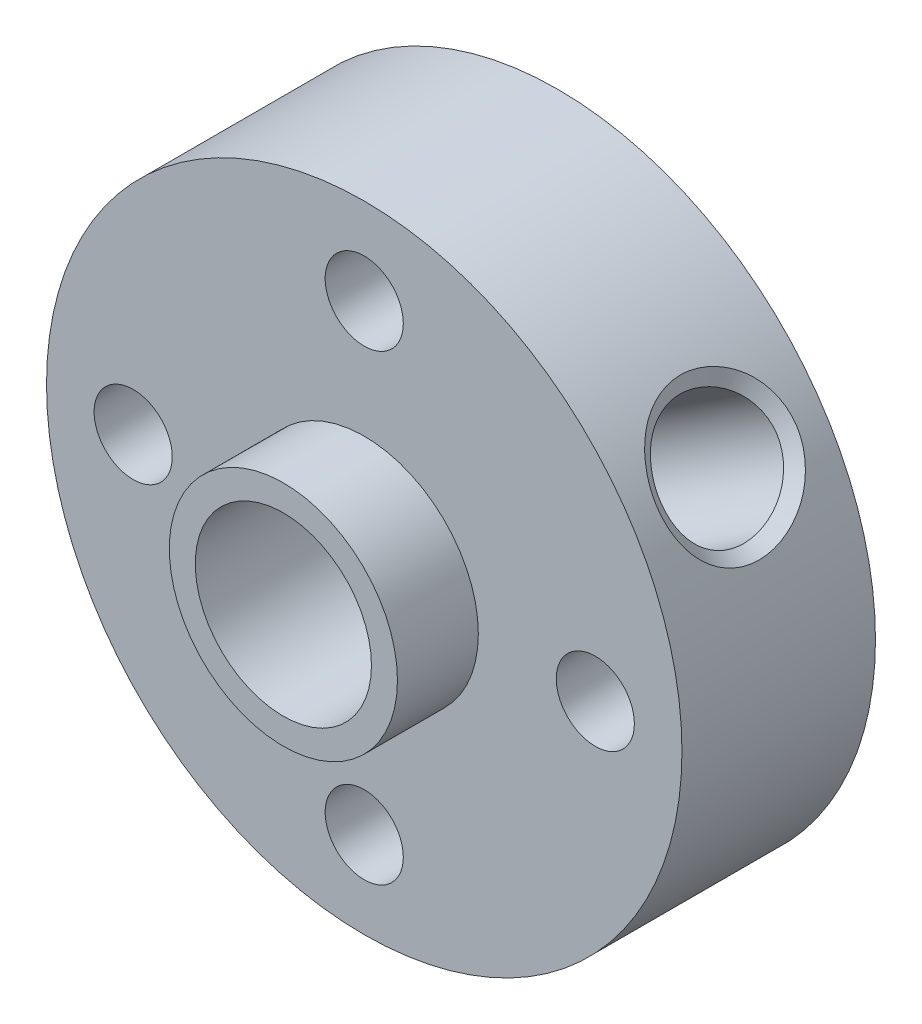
ISO-10303-21;
HEADER;
FILE_DESCRIPTION(('STEP AP214'),'2;1');
FILE_NAME('part.step','',(''),(''),'','','');
FILE_SCHEMA(('AUTOMOTIVE_DESIGN { 1 0 10303 214 1 1 1 1 }'));
ENDSEC;
DATA;
#1=APPLICATION_CONTEXT('core data for automotive mechanical design processes');
#2=APPLICATION_PROTOCOL_DEFINITION('international standard','automotive_design',2000,#1);
#3=PRODUCT_CONTEXT('',#1,'mechanical');
#4=PRODUCT('Part','Part','',(#3));
#5=PRODUCT_RELATED_PRODUCT_CATEGORY('part','',(#4));
#6=PRODUCT_DEFINITION_FORMATION('','',#4);
#7=PRODUCT_DEFINITION_CONTEXT('part definition',#1,'design');
#8=PRODUCT_DEFINITION('design','',#6,#7);
#9=PRODUCT_DEFINITION_SHAPE('','',#8);
#10=(LENGTH_UNIT() NAMED_UNIT(*) SI_UNIT(.MILLI.,.METRE.));
#11=(NAMED_UNIT(*) PLANE_ANGLE_UNIT() SI_UNIT($,.RADIAN.));
#12=(NAMED_UNIT(*) SI_UNIT($,.STERADIAN.) SOLID_ANGLE_UNIT());
#13=UNCERTAINTY_MEASURE_WITH_UNIT(LENGTH_MEASURE(1.E-05),#10,'distance_accuracy_value','');
#14=(GEOMETRIC_REPRESENTATION_CONTEXT(3) GLOBAL_UNCERTAINTY_ASSIGNED_CONTEXT((#13)) GLOBAL_UNIT_ASSIGNED_CONTEXT((#10,
#11,#12)) REPRESENTATION_CONTEXT('',''));
#15=CARTESIAN_POINT('',(0.,0.,0.));
#16=DIRECTION('',(0.,0.,1.));
#17=DIRECTION('',(1.,0.,0.));
#18=AXIS2_PLACEMENT_3D('',#15,#16,#17);
#19=CARTESIAN_POINT('',(0.,0.,0.));
#20=DIRECTION('',(0.,0.,1.));
#21=DIRECTION('',(1.,0.,0.));
#22=AXIS2_PLACEMENT_3D('',#19,#20,#21);
#23=PLANE('',#22);
#24=CARTESIAN_POINT('',(0.,8.,0.));
#25=DIRECTION('',(0.,0.,1.));
#26=DIRECTION('',(1.,0.,0.));
#27=AXIS2_PLACEMENT_3D('',#24,#25,#26);
#28=CIRCLE('',#27,1.35254999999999);
#29=CARTESIAN_POINT('',(1.35254999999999,8.,0.));
#30=VERTEX_POINT('',#29);
#31=EDGE_CURVE('E341',#30,#30,#28,.T.);
#32=ORIENTED_EDGE('',*,*,#31,.F.);
#33=EDGE_LOOP('',(#32));
#34=FACE_BOUND('',#33,.T.);
#35=CARTESIAN_POINT('',(-8.,0.,0.));
#36=DIRECTION('',(0.,0.,1.));
#37=DIRECTION('',(1.,0.,0.));
#38=AXIS2_PLACEMENT_3D('',#35,#36,#37);
#39=CIRCLE('',#38,1.35254999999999);
#40=CARTESIAN_POINT('',(-6.64745000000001,0.,0.));
#41=VERTEX_POINT('',#40);
#42=EDGE_CURVE('E343',#41,#41,#39,.T.);
#43=ORIENTED_EDGE('',*,*,#42,.F.);
#44=EDGE_LOOP('',(#43));
#45=FACE_BOUND('',#44,.T.);
#46=CARTESIAN_POINT('',(8.,0.,0.));
#47=DIRECTION('',(0.,0.,1.));
#48=DIRECTION('',(1.,0.,0.));
#49=AXIS2_PLACEMENT_3D('',#46,#47,#48);
#50=CIRCLE('',#49,1.35254999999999);
#51=CARTESIAN_POINT('',(9.35254999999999,0.,0.));
#52=VERTEX_POINT('',#51);
#53=EDGE_CURVE('E232',#52,#52,#50,.T.);
#54=ORIENTED_EDGE('',*,*,#53,.F.);
#55=EDGE_LOOP('',(#54));
#56=FACE_BOUND('',#55,.T.);
#57=CARTESIAN_POINT('',(0.,-8.,0.));
#58=DIRECTION('',(0.,0.,1.));
#59=DIRECTION('',(1.,0.,0.));
#60=AXIS2_PLACEMENT_3D('',#57,#58,#59);
#61=CIRCLE('',#60,1.35254999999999);
#62=CARTESIAN_POINT('',(1.35254999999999,-8.,0.));
#63=VERTEX_POINT('',#62);
#64=EDGE_CURVE('E231',#63,#63,#61,.T.);
#65=ORIENTED_EDGE('',*,*,#64,.F.);
#66=EDGE_LOOP('',(#65));
#67=FACE_BOUND('',#66,.T.);
#68=CARTESIAN_POINT('',(0.,0.,0.));
#69=DIRECTION('',(0.,0.,1.));
#70=DIRECTION('',(1.,0.,0.));
#71=AXIS2_PLACEMENT_3D('',#68,#69,#70);
#72=CIRCLE('',#71,11.);
#73=CARTESIAN_POINT('',(11.,0.,0.));
#74=VERTEX_POINT('',#73);
#75=EDGE_CURVE('E128',#74,#74,#72,.T.);
#76=ORIENTED_EDGE('',*,*,#75,.T.);
#77=EDGE_LOOP('',(#76));
#78=FACE_BOUND('',#77,.T.);
#79=CARTESIAN_POINT('',(0.,0.,0.));
#80=DIRECTION('',(0.,0.,1.));
#81=DIRECTION('',(1.,0.,0.));
#82=AXIS2_PLACEMENT_3D('',#79,#80,#81);
#83=CIRCLE('',#82,3.95);
#84=CARTESIAN_POINT('',(3.95,0.,0.));
#85=VERTEX_POINT('',#84);
#86=EDGE_CURVE('E135',#85,#85,#83,.T.);
#87=ORIENTED_EDGE('',*,*,#86,.F.);
#88=EDGE_LOOP('',(#87));
#89=FACE_BOUND('',#88,.T.);
#90=ADVANCED_FACE('F31',(#34,#45,#56,#67,#78,#89),#23,.T.);
#91=CARTESIAN_POINT('',(0.,0.,-6.7));
#92=DIRECTION('',(0.,0.,1.));
#93=DIRECTION('',(1.,0.,0.));
#94=AXIS2_PLACEMENT_3D('',#91,#92,#93);
#95=CYLINDRICAL_SURFACE('',#94,11.);
#96=CARTESIAN_POINT('',(7.62068264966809,7.93254032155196,-3.32685345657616));
#97=CARTESIAN_POINT('',(7.62075976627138,7.93245790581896,-2.68910121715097));
#98=CARTESIAN_POINT('',(7.82560646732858,7.74245905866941,-2.06178912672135));
#99=CARTESIAN_POINT('',(8.45565411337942,7.05350504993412,-1.16750041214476));
#100=CARTESIAN_POINT('',(8.86420959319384,6.54676611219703,-0.905037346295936));
#101=CARTESIAN_POINT('',(9.58057771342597,5.4444732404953,-0.905479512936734));
#102=CARTESIAN_POINT('',(9.87817200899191,4.86515984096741,-1.16662287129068));
#103=CARTESIAN_POINT('',(10.2532621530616,4.00757133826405,-2.06110272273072));
#104=CARTESIAN_POINT('',(10.3434017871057,3.743514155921,-2.68660918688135));
#105=CARTESIAN_POINT('',(10.343489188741,3.74331038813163,-3.96681461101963));
#106=CARTESIAN_POINT('',(10.2534497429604,4.00705371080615,-4.59170482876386));
#107=CARTESIAN_POINT('',(9.87860064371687,4.86427917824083,-5.48652188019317));
#108=CARTESIAN_POINT('',(9.58062819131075,5.4444282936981,-5.74828985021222));
#109=CARTESIAN_POINT('',(8.8641064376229,6.54689208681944,-5.74860707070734));
#110=CARTESIAN_POINT('',(8.4560806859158,7.05297750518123,-5.48645317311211));
#111=CARTESIAN_POINT('',(7.8258487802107,7.74225053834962,-4.59262259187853));
#112=CARTESIAN_POINT('',(7.6206055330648,7.93262273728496,-3.96460569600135));
#113=CARTESIAN_POINT('',(7.62068264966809,7.93254032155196,-3.32685345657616));
#114=B_SPLINE_CURVE_WITH_KNOTS('',3,(#96,#97,#98,#99,#100,#101,#102,#103,#104,#105,#106,#107,
#108,#109,#110,#111,#112,#113),.UNSPECIFIED.,.T.,.F.,(4,2,2,2,2,2,2,2,4),(-3.18999496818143E-06,
0.00189587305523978,0.00379493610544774,0.00569399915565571,0.00759306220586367,
0.00949212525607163,0.0113911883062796,0.0132902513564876,0.0151893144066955),.UNSPECIFIED.);
#115=CARTESIAN_POINT('',(7.62068264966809,7.93254032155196,-3.32685345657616));
#116=VERTEX_POINT('',#115);
#117=EDGE_CURVE('E11',#116,#116,#114,.F.);
#118=ORIENTED_EDGE('',*,*,#117,.T.);
#119=EDGE_LOOP('',(#118));
#120=FACE_BOUND('',#119,.T.);
#121=CARTESIAN_POINT('',(0.,0.,-6.7));
#122=DIRECTION('',(0.,0.,1.));
#123=DIRECTION('',(1.,0.,0.));
#124=AXIS2_PLACEMENT_3D('',#121,#122,#123);
#125=CIRCLE('',#124,11.);
#126=CARTESIAN_POINT('',(11.,0.,-6.7));
#127=VERTEX_POINT('',#126);
#128=EDGE_CURVE('E125',#127,#127,#125,.T.);
#129=ORIENTED_EDGE('',*,*,#128,.T.);
#130=EDGE_LOOP('',(#129));
#131=FACE_BOUND('',#130,.T.);
#132=ORIENTED_EDGE('',*,*,#75,.F.);
#133=EDGE_LOOP('',(#132));
#134=FACE_BOUND('',#133,.T.);
#135=ADVANCED_FACE('F84',(#120,#131,#134),#95,.T.);
#136=CARTESIAN_POINT('',(0.,0.,-6.7));
#137=DIRECTION('',(0.,0.,1.));
#138=DIRECTION('',(1.,0.,0.));
#139=AXIS2_PLACEMENT_3D('',#136,#137,#138);
#140=PLANE('',#139);
#141=CARTESIAN_POINT('',(0.,8.,-6.7));
#142=DIRECTION('',(0.,0.,1.));
#143=DIRECTION('',(1.,0.,0.));
#144=AXIS2_PLACEMENT_3D('',#141,#142,#143);
#145=CIRCLE('',#144,1.35255);
#146=CARTESIAN_POINT('',(1.35255,8.,-6.7));
#147=VERTEX_POINT('',#146);
#148=EDGE_CURVE('E216',#147,#147,#145,.T.);
#149=ORIENTED_EDGE('',*,*,#148,.T.);
#150=EDGE_LOOP('',(#149));
#151=FACE_BOUND('',#150,.T.);
#152=CARTESIAN_POINT('',(-8.,0.,-6.7));
#153=DIRECTION('',(0.,0.,1.));
#154=DIRECTION('',(1.,0.,0.));
#155=AXIS2_PLACEMENT_3D('',#152,#153,#154);
#156=CIRCLE('',#155,1.35255);
#157=CARTESIAN_POINT('',(-6.64745,0.,-6.7));
#158=VERTEX_POINT('',#157);
#159=EDGE_CURVE('E220',#158,#158,#156,.T.);
#160=ORIENTED_EDGE('',*,*,#159,.T.);
#161=EDGE_LOOP('',(#160));
#162=FACE_BOUND('',#161,.T.);
#163=CARTESIAN_POINT('',(8.,0.,-6.7));
#164=DIRECTION('',(0.,0.,1.));
#165=DIRECTION('',(1.,0.,0.));
#166=AXIS2_PLACEMENT_3D('',#163,#164,#165);
#167=CIRCLE('',#166,1.35255);
#168=CARTESIAN_POINT('',(9.35255,0.,-6.7));
#169=VERTEX_POINT('',#168);
#170=EDGE_CURVE('E224',#169,#169,#167,.T.);
#171=ORIENTED_EDGE('',*,*,#170,.T.);
#172=EDGE_LOOP('',(#171));
#173=FACE_BOUND('',#172,.T.);
#174=CARTESIAN_POINT('',(0.,-8.,-6.7));
#175=DIRECTION('',(0.,0.,1.));
#176=DIRECTION('',(1.,0.,0.));
#177=AXIS2_PLACEMENT_3D('',#174,#175,#176);
#178=CIRCLE('',#177,1.35255);
#179=CARTESIAN_POINT('',(1.35255,-8.,-6.7));
#180=VERTEX_POINT('',#179);
#181=EDGE_CURVE('E228',#180,#180,#178,.T.);
#182=ORIENTED_EDGE('',*,*,#181,.T.);
#183=EDGE_LOOP('',(#182));
#184=FACE_BOUND('',#183,.T.);
#185=CARTESIAN_POINT('',(0.,0.,-6.7));
#186=DIRECTION('',(0.,0.,1.));
#187=DIRECTION('',(1.,0.,0.));
#188=AXIS2_PLACEMENT_3D('',#185,#186,#187);
#189=CIRCLE('',#188,3.05);
#190=CARTESIAN_POINT('',(3.05,0.,-6.7));
#191=VERTEX_POINT('',#190);
#192=EDGE_CURVE('E190',#191,#191,#189,.T.);
#193=ORIENTED_EDGE('',*,*,#192,.T.);
#194=EDGE_LOOP('',(#193));
#195=FACE_BOUND('',#194,.T.);
#196=ORIENTED_EDGE('',*,*,#128,.F.);
#197=EDGE_LOOP('',(#196));
#198=FACE_BOUND('',#197,.T.);
#199=ADVANCED_FACE('F90',(#151,#162,#173,#184,#195,#198),#140,.F.);
#200=CARTESIAN_POINT('',(0.,0.,2.8));
#201=DIRECTION('',(0.,0.,-1.));
#202=DIRECTION('',(-1.,0.,0.));
#203=AXIS2_PLACEMENT_3D('',#200,#201,#202);
#204=CYLINDRICAL_SURFACE('',#203,3.95);
#205=CARTESIAN_POINT('',(0.,0.,2.8));
#206=DIRECTION('',(0.,0.,1.));
#207=DIRECTION('',(1.,0.,0.));
#208=AXIS2_PLACEMENT_3D('',#205,#206,#207);
#209=CIRCLE('',#208,3.95);
#210=CARTESIAN_POINT('',(3.95,0.,2.8));
#211=VERTEX_POINT('',#210);
#212=EDGE_CURVE('E130',#211,#211,#209,.T.);
#213=ORIENTED_EDGE('',*,*,#212,.F.);
#214=EDGE_LOOP('',(#213));
#215=FACE_BOUND('',#214,.T.);
#216=ORIENTED_EDGE('',*,*,#86,.T.);
#217=EDGE_LOOP('',(#216));
#218=FACE_BOUND('',#217,.T.);
#219=ADVANCED_FACE('F200',(#215,#218),#204,.T.);
#220=CARTESIAN_POINT('',(0.,0.,2.8));
#221=DIRECTION('',(0.,0.,1.));
#222=DIRECTION('',(1.,0.,0.));
#223=AXIS2_PLACEMENT_3D('',#220,#221,#222);
#224=PLANE('',#223);
#225=CARTESIAN_POINT('',(0.,0.,2.8));
#226=DIRECTION('',(0.,0.,1.));
#227=DIRECTION('',(1.,0.,0.));
#228=AXIS2_PLACEMENT_3D('',#225,#226,#227);
#229=CIRCLE('',#228,3.05);
#230=CARTESIAN_POINT('',(3.05,0.,2.8));
#231=VERTEX_POINT('',#230);
#232=EDGE_CURVE('E170',#231,#231,#229,.T.);
#233=ORIENTED_EDGE('',*,*,#232,.F.);
#234=EDGE_LOOP('',(#233));
#235=FACE_BOUND('',#234,.T.);
#236=ORIENTED_EDGE('',*,*,#212,.T.);
#237=EDGE_LOOP('',(#236));
#238=FACE_BOUND('',#237,.T.);
#239=ADVANCED_FACE('F78',(#235,#238),#224,.T.);
#240=CARTESIAN_POINT('',(0.,0.,-6.7));
#241=DIRECTION('',(0.,0.,1.));
#242=DIRECTION('',(1.,0.,0.));
#243=AXIS2_PLACEMENT_3D('',#240,#241,#242);
#244=CYLINDRICAL_SURFACE('',#243,3.05);
#245=CARTESIAN_POINT('',(3.05,0.,-4.47352631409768));
#246=CARTESIAN_POINT('',(3.04999845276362,0.0792072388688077,-4.56979697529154));
#247=CARTESIAN_POINT('',(3.04689484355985,0.165980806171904,-4.65986221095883));
#248=CARTESIAN_POINT('',(3.03113479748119,0.35127712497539,-4.82649271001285));
#249=CARTESIAN_POINT('',(3.0184552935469,0.44982776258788,-4.90302482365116));
#250=CARTESIAN_POINT('',(2.98050916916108,0.655805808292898,-5.04073084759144));
#251=CARTESIAN_POINT('',(2.9551778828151,0.763276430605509,-5.10182340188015));
#252=CARTESIAN_POINT('',(2.88965422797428,0.982557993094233,-5.20524126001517));
#253=CARTESIAN_POINT('',(2.84949150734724,1.09435987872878,-5.24760363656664));
#254=CARTESIAN_POINT('',(2.75910951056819,1.30434664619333,-5.30711696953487));
#255=CARTESIAN_POINT('',(2.71061209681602,1.40259718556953,-5.32663418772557));
#256=CARTESIAN_POINT('',(2.60225104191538,1.59464910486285,-5.34754198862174));
#257=CARTESIAN_POINT('',(2.5423958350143,1.68845372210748,-5.34894596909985));
#258=CARTESIAN_POINT('',(2.42209874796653,1.8561185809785,-5.33458313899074));
#259=CARTESIAN_POINT('',(2.362764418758,1.93098074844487,-5.32104524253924));
#260=CARTESIAN_POINT('',(2.23932539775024,2.07286356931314,-5.28099605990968));
#261=CARTESIAN_POINT('',(2.17522019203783,2.13988337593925,-5.2544833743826));
#262=CARTESIAN_POINT('',(2.04291754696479,2.26662535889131,-5.18889881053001));
#263=CARTESIAN_POINT('',(1.97465875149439,2.32613309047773,-5.14954003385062));
#264=CARTESIAN_POINT('',(1.83780246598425,2.43570893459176,-5.05990005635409));
#265=CARTESIAN_POINT('',(1.76920490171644,2.48577487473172,-5.00961634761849));
#266=CARTESIAN_POINT('',(1.62406015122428,2.58333625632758,-4.89147472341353));
#267=CARTESIAN_POINT('',(1.54778391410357,2.62943309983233,-4.82213059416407));
#268=CARTESIAN_POINT('',(1.40051133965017,2.7107499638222,-4.6721293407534));
#269=CARTESIAN_POINT('',(1.32952492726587,2.7459499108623,-4.59145173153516));
#270=CARTESIAN_POINT('',(1.1870136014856,2.8107696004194,-4.40784888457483));
#271=CARTESIAN_POINT('',(1.11678294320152,2.83893553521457,-4.30338997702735));
#272=CARTESIAN_POINT('',(0.994036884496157,2.88421390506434,-4.08241277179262));
#273=CARTESIAN_POINT('',(0.94147426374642,2.90135591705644,-3.96592772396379));
#274=CARTESIAN_POINT('',(0.87394109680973,2.92225371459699,-3.76122271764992));
#275=CARTESIAN_POINT('',(0.852367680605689,2.92851221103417,-3.67544002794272));
#276=CARTESIAN_POINT('',(0.823406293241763,2.93679098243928,-3.50136018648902));
#277=CARTESIAN_POINT('',(0.815997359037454,2.93881752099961,-3.41306694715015));
#278=CARTESIAN_POINT('',(0.816229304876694,2.93875307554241,-3.23638008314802));
#279=CARTESIAN_POINT('',(0.823891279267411,2.93665632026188,-3.14798649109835));
#280=CARTESIAN_POINT('',(0.85337210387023,2.92822113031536,-2.97375701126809));
#281=CARTESIAN_POINT('',(0.875210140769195,2.92187694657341,-2.88792475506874));
#282=CARTESIAN_POINT('',(0.937500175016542,2.90256511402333,-2.70075411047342));
#283=CARTESIAN_POINT('',(0.981155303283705,2.888376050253,-2.6006182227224));
#284=CARTESIAN_POINT('',(1.08203096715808,2.85211716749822,-2.40900904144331));
#285=CARTESIAN_POINT('',(1.1392697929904,2.83003670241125,-2.31754766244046));
#286=CARTESIAN_POINT('',(1.26426811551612,2.7764779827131,-2.14265267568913));
#287=CARTESIAN_POINT('',(1.33219299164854,2.74484324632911,-2.05938598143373));
#288=CARTESIAN_POINT('',(1.47437333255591,2.67116870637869,-1.90352244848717));
#289=CARTESIAN_POINT('',(1.54863054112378,2.62912603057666,-1.83092856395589));
#290=CARTESIAN_POINT('',(1.71233477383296,2.52609439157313,-1.68720166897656));
#291=CARTESIAN_POINT('',(1.8023450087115,2.46317348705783,-1.61806101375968));
#292=CARTESIAN_POINT('',(1.98200701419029,2.3210380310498,-1.49847534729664));
#293=CARTESIAN_POINT('',(2.07165903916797,2.2418385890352,-1.44801311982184));
#294=CARTESIAN_POINT('',(2.23567712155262,2.07754134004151,-1.37337031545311));
#295=CARTESIAN_POINT('',(2.31063207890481,1.99409036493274,-1.34688380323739));
#296=CARTESIAN_POINT('',(2.4523100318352,1.81699643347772,-1.31301269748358));
#297=CARTESIAN_POINT('',(2.51904329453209,1.7233664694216,-1.3056040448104));
#298=CARTESIAN_POINT('',(2.6320594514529,1.54411282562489,-1.3100321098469));
#299=CARTESIAN_POINT('',(2.6799083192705,1.4593911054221,-1.31915191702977));
#300=CARTESIAN_POINT('',(2.7664283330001,1.28786517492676,-1.35101378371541));
#301=CARTESIAN_POINT('',(2.80509877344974,1.20106080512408,-1.37375688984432));
#302=CARTESIAN_POINT('',(2.87294430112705,1.02825003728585,-1.43166343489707));
#303=CARTESIAN_POINT('',(2.90214467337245,0.9422421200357,-1.46679326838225));
#304=CARTESIAN_POINT('',(2.95173421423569,0.773013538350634,-1.54811665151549));
#305=CARTESIAN_POINT('',(2.97212172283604,0.68979340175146,-1.59431228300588));
#306=CARTESIAN_POINT('',(3.00725035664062,0.517362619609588,-1.70318361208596));
#307=CARTESIAN_POINT('',(3.02090228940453,0.428794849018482,-1.76722529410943));
#308=CARTESIAN_POINT('',(3.04011293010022,0.259750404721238,-1.90642473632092));
#309=CARTESIAN_POINT('',(3.04565902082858,0.179286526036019,-1.98159962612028));
#310=CARTESIAN_POINT('',(3.05118088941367,0.0173597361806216,-2.15425251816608));
#311=CARTESIAN_POINT('',(3.05017909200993,-0.062387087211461,-2.2533835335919));
#312=CARTESIAN_POINT('',(3.04402332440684,-0.203501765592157,-2.46385038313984));
#313=CARTESIAN_POINT('',(3.03887650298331,-0.264901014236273,-2.57516491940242));
#314=CARTESIAN_POINT('',(3.03010831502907,-0.34959950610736,-2.77503750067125));
#315=CARTESIAN_POINT('',(3.02646815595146,-0.37876533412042,-2.86110005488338));
#316=CARTESIAN_POINT('',(3.02068619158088,-0.422436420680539,-3.03686306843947));
#317=CARTESIAN_POINT('',(3.01854177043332,-0.436967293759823,-3.12655688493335));
#318=CARTESIAN_POINT('',(3.0166323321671,-0.449978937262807,-3.30751193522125));
#319=CARTESIAN_POINT('',(3.01687670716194,-0.448396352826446,-3.39877794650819));
#320=CARTESIAN_POINT('',(3.01966444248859,-0.429197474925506,-3.57962333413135));
#321=CARTESIAN_POINT('',(3.02221026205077,-0.41156403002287,-3.66920080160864));
#322=CARTESIAN_POINT('',(3.02840275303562,-0.363087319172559,-3.84032478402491));
#323=CARTESIAN_POINT('',(3.03199637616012,-0.332855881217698,-3.92205119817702));
#324=CARTESIAN_POINT('',(3.03898971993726,-0.261389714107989,-4.08041768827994));
#325=CARTESIAN_POINT('',(3.04238955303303,-0.220161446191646,-4.15706071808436));
#326=CARTESIAN_POINT('',(3.04801811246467,-0.121860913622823,-4.31556083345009));
#327=CARTESIAN_POINT('',(3.05000123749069,-0.063350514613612,-4.39652835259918));
#328=CARTESIAN_POINT('',(3.05,0.,-4.47352631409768));
#329=B_SPLINE_CURVE_WITH_KNOTS('',3,(#245,#246,#247,#248,#249,#250,#251,#252,#253,#254,#255,
#256,#257,#258,#259,#260,#261,#262,#263,#264,#265,#266,#267,#268,#269,#270,#271,#272,#273,#274,
#275,#276,#277,#278,#279,#280,#281,#282,#283,#284,#285,#286,#287,#288,#289,#290,#291,#292,#293,
#294,#295,#296,#297,#298,#299,#300,#301,#302,#303,#304,#305,#306,#307,#308,#309,#310,#311,#312,
#313,#314,#315,#316,#317,#318,#319,#320,#321,#322,#323,#324,#325,#326,#327,#328),.UNSPECIFIED.,
.T.,.F.,(4,2,2,2,2,2,2,2,2,2,2,2,2,2,2,2,2,2,2,2,2,2,2,2,2,2,2,2,2,2,2,2,2,2,2,2,2,2,2,2,2,4),
(0.,0.373643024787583,0.748188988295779,1.12466923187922,1.50040093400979,1.83225979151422,
2.16387316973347,2.45197347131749,2.74010485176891,3.03517051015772,3.33030397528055,
3.66776750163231,4.00584902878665,4.39088121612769,4.77487601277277,5.03978671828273,
5.30430505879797,5.56919390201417,5.83444201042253,6.16314301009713,6.49228913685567,
6.82714887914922,7.1621011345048,7.54927556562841,7.93609223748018,8.27970440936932,
8.62288303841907,8.91464938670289,9.20643815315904,9.49744130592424,9.78849924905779,
10.1176764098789,10.4473654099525,10.8272920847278,11.2065649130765,11.4783105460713,
11.7495797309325,12.0219159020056,12.2945434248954,12.55524078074,12.8157852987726,
13.1146276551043),.UNSPECIFIED.);
#330=CARTESIAN_POINT('',(3.05,0.,-4.47352631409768));
#331=VERTEX_POINT('',#330);
#332=EDGE_CURVE('E165',#331,#331,#329,.T.);
#333=ORIENTED_EDGE('',*,*,#332,.T.);
#334=EDGE_LOOP('',(#333));
#335=FACE_BOUND('',#334,.T.);
#336=CARTESIAN_POINT('',(-3.0483868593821,-0.0991844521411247,-2.06702311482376));
#337=CARTESIAN_POINT('',(-3.04962662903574,-0.0611311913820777,-2.10785039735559));
#338=CARTESIAN_POINT('',(-3.05010465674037,-0.0244454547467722,-2.14994255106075));
#339=CARTESIAN_POINT('',(-3.04985766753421,0.0458847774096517,-2.23666619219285));
#340=CARTESIAN_POINT('',(-3.04913133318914,0.0795259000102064,-2.28130040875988));
#341=CARTESIAN_POINT('',(-3.04560787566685,0.175808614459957,-2.41962154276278));
#342=CARTESIAN_POINT('',(-3.041456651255,0.233192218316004,-2.51707607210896));
#343=CARTESIAN_POINT('',(-3.03326755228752,0.32159443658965,-2.70313131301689));
#344=CARTESIAN_POINT('',(-3.02933210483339,0.355445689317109,-2.79038841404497));
#345=CARTESIAN_POINT('',(-3.02268886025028,0.408126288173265,-2.969107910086));
#346=CARTESIAN_POINT('',(-3.01997612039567,0.427016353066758,-3.06055169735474));
#347=CARTESIAN_POINT('',(-3.01692267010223,0.448114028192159,-3.24604798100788));
#348=CARTESIAN_POINT('',(-3.01659769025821,0.450211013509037,-3.3401136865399));
#349=CARTESIAN_POINT('',(-3.01851234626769,0.437170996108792,-3.52707719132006));
#350=CARTESIAN_POINT('',(-3.02075449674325,0.42201709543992,-3.61997375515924));
#351=CARTESIAN_POINT('',(-3.026565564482,0.377937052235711,-3.79450936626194));
#352=CARTESIAN_POINT('',(-3.03001633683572,0.350187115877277,-3.87645932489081));
#353=CARTESIAN_POINT('',(-3.03699096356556,0.283391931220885,-4.03567131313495));
#354=CARTESIAN_POINT('',(-3.04051490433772,0.244332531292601,-4.11292732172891));
#355=CARTESIAN_POINT('',(-3.04618235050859,0.158307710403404,-4.25949182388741));
#356=CARTESIAN_POINT('',(-3.04836733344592,0.111643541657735,-4.32897785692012));
#357=CARTESIAN_POINT('',(-3.05039526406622,0.0112164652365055,-4.4621470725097));
#358=CARTESIAN_POINT('',(-3.05024931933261,-0.0425115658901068,-4.52585632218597));
#359=CARTESIAN_POINT('',(-3.0483868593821,-0.0991844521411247,-4.58668379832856));
#360=B_SPLINE_CURVE_WITH_KNOTS('',3,(#336,#337,#338,#339,#340,#341,#342,#343,#344,#345,#346,
#347,#348,#349,#350,#351,#352,#353,#354,#355,#356,#357,#358,#359),.UNSPECIFIED.,.F.,.F.,(4,2,2,
2,2,2,2,2,2,2,2,4),(0.,0.167386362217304,0.334955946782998,0.672760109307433,0.952690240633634,
1.23147839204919,1.51210157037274,1.79299986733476,2.0518180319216,2.31096146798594,
2.56160715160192,2.81105878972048),.UNSPECIFIED.);
#361=CARTESIAN_POINT('',(-3.0483868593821,-0.0991844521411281,-2.06702311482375));
#362=VERTEX_POINT('',#361);
#363=CARTESIAN_POINT('',(-3.0483868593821,-0.0991844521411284,-4.58668379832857));
#364=VERTEX_POINT('',#363);
#365=EDGE_CURVE('E144',#362,#364,#360,.T.);
#366=ORIENTED_EDGE('',*,*,#365,.T.);
#367=CARTESIAN_POINT('',(-2.98979418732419,0.603018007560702,-5.04101852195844));
#368=CARTESIAN_POINT('',(-2.99665081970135,0.568983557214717,-5.00732181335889));
#369=CARTESIAN_POINT('',(-3.00309339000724,0.534078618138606,-4.97437045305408));
#370=CARTESIAN_POINT('',(-3.01500152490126,0.462181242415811,-4.91038231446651));
#371=CARTESIAN_POINT('',(-3.0204635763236,0.425181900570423,-4.8793526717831));
#372=CARTESIAN_POINT('',(-3.0302836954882,0.348418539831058,-4.81943389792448));
#373=CARTESIAN_POINT('',(-3.03462413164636,0.308621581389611,-4.79058347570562));
#374=CARTESIAN_POINT('',(-3.04184330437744,0.226675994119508,-4.73634829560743));
#375=CARTESIAN_POINT('',(-3.044724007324,0.184530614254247,-4.71095890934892));
#376=CARTESIAN_POINT('',(-3.04966468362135,0.0777993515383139,-4.65376663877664));
#377=CARTESIAN_POINT('',(-3.05073671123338,0.0118128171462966,-4.62439010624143));
#378=CARTESIAN_POINT('',(-3.04824092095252,-0.123493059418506,-4.57740707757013));
#379=CARTESIAN_POINT('',(-3.04471599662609,-0.192775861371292,-4.55969406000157));
#380=CARTESIAN_POINT('',(-3.03112308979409,-0.349868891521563,-4.53262484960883));
#381=CARTESIAN_POINT('',(-3.01966730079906,-0.438071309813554,-4.52636637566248));
#382=CARTESIAN_POINT('',(-2.98895238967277,-0.613827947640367,-4.52545362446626));
#383=CARTESIAN_POINT('',(-2.96960675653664,-0.701363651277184,-4.53093095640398));
#384=CARTESIAN_POINT('',(-2.92457316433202,-0.869833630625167,-4.54618757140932));
#385=CARTESIAN_POINT('',(-2.89922815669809,-0.950884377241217,-4.55575130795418));
#386=CARTESIAN_POINT('',(-2.84185334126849,-1.11066436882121,-4.57466458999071));
#387=CARTESIAN_POINT('',(-2.80982031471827,-1.1893924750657,-4.58401402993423));
#388=CARTESIAN_POINT('',(-2.73940940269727,-1.34359983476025,-4.59947997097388));
#389=CARTESIAN_POINT('',(-2.70108092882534,-1.41909903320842,-4.60562020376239));
#390=CARTESIAN_POINT('',(-2.61816787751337,-1.56679985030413,-4.61318166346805));
#391=CARTESIAN_POINT('',(-2.57358659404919,-1.63900317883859,-4.61460536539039));
#392=CARTESIAN_POINT('',(-2.48078540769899,-1.776159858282,-4.6124495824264));
#393=CARTESIAN_POINT('',(-2.43282635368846,-1.84129385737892,-4.60909668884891));
#394=CARTESIAN_POINT('',(-2.33204242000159,-1.96738381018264,-4.59854976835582));
#395=CARTESIAN_POINT('',(-2.27921479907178,-2.02833737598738,-4.59135356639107));
#396=CARTESIAN_POINT('',(-2.16874063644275,-2.14607189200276,-4.57485716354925));
#397=CARTESIAN_POINT('',(-2.11106692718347,-2.20282542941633,-4.56554452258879));
#398=CARTESIAN_POINT('',(-1.9913606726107,-2.31160562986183,-4.54780547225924));
#399=CARTESIAN_POINT('',(-1.92933136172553,-2.36363573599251,-4.53937841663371));
#400=CARTESIAN_POINT('',(-1.79989130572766,-2.46367197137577,-4.52759746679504));
#401=CARTESIAN_POINT('',(-1.73240980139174,-2.51159949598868,-4.5243277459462));
#402=CARTESIAN_POINT('',(-1.59434797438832,-2.60139217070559,-4.52887366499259));
#403=CARTESIAN_POINT('',(-1.52379682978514,-2.64330283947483,-4.53660064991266));
#404=CARTESIAN_POINT('',(-1.38096498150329,-2.72068448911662,-4.56756006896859));
#405=CARTESIAN_POINT('',(-1.30867423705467,-2.75604888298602,-4.59102446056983));
#406=CARTESIAN_POINT('',(-1.16688227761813,-2.81904041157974,-4.65301024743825));
#407=CARTESIAN_POINT('',(-1.09739696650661,-2.84662763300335,-4.69160696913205));
#408=CARTESIAN_POINT('',(-1.00655500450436,-2.87923394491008,-4.75110320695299));
#409=CARTESIAN_POINT('',(-0.983055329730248,-2.88733490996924,-4.76736614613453));
#410=CARTESIAN_POINT('',(-0.936791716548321,-2.90267263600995,-4.80095580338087));
#411=CARTESIAN_POINT('',(-0.914023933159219,-2.90991477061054,-4.81827475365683));
#412=CARTESIAN_POINT('',(-0.89152514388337,-2.91679325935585,-4.83609366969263));
#413=B_SPLINE_CURVE_WITH_KNOTS('',3,(#367,#368,#369,#370,#371,#372,#373,#374,#375,#376,#377,
#378,#379,#380,#381,#382,#383,#384,#385,#386,#387,#388,#389,#390,#391,#392,#393,#394,#395,#396,
#397,#398,#399,#400,#401,#402,#403,#404,#405,#406,#407,#408,#409,#410,#411,#412),.UNSPECIFIED.,
.F.,.F.,(4,2,2,2,2,2,2,2,2,2,2,2,2,2,2,2,2,2,2,2,2,2,4),(0.,0.145181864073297,0.290873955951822,
0.438733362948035,0.586393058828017,0.80201251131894,1.01563436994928,1.28143135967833,
1.55022467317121,1.8063146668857,2.06252819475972,2.31681924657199,2.57097683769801,
2.81347149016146,3.05610352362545,3.30020038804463,3.54411786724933,3.79197661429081,
4.03784841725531,4.28742623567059,4.53826251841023,4.62735573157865,4.71585825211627),.UNSPECIFIED.);
#414=CARTESIAN_POINT('',(-1.32837016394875,-2.74552958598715,-4.58668379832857));
#415=VERTEX_POINT('',#414);
#416=EDGE_CURVE('E56',#364,#415,#413,.T.);
#417=ORIENTED_EDGE('',*,*,#416,.T.);
#418=CARTESIAN_POINT('',(-1.32837016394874,-2.74552958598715,-4.58668379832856));
#419=CARTESIAN_POINT('',(-1.29409816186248,-2.7621132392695,-4.54585651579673));
#420=CARTESIAN_POINT('',(-1.26076659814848,-2.77744551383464,-4.50376436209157));
#421=CARTESIAN_POINT('',(-1.1963942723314,-2.8057758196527,-4.41704072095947));
#422=CARTESIAN_POINT('',(-1.16535605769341,-2.81877127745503,-4.37240650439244));
#423=CARTESIAN_POINT('',(-1.07593643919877,-2.85464477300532,-4.23408537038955));
#424=CARTESIAN_POINT('',(-1.02181030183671,-2.87415046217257,-4.13663084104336));
#425=CARTESIAN_POINT('',(-0.937697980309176,-2.90256051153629,-3.95057560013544));
#426=CARTESIAN_POINT('',(-0.905164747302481,-2.91270860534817,-3.86331849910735));
#427=CARTESIAN_POINT('',(-0.854324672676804,-2.92802738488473,-3.68459900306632));
#428=CARTESIAN_POINT('',(-0.835960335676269,-2.93321820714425,-3.59315521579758));
#429=CARTESIAN_POINT('',(-0.815440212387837,-2.93899401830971,-3.40765893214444));
#430=CARTESIAN_POINT('',(-0.813391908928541,-2.93954846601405,-3.31359322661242));
#431=CARTESIAN_POINT('',(-0.82608607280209,-2.93600358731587,-3.12662972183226));
#432=CARTESIAN_POINT('',(-0.84084500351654,-2.93189969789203,-3.03373315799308));
#433=CARTESIAN_POINT('',(-0.883487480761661,-2.91931248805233,-2.85919754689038));
#434=CARTESIAN_POINT('',(-0.91024816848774,-2.91119877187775,-2.77724758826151));
#435=CARTESIAN_POINT('',(-0.974121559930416,-2.89045191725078,-2.61803560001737));
#436=CARTESIAN_POINT('',(-1.01124723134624,-2.877813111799,-2.54077959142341));
#437=CARTESIAN_POINT('',(-1.09216308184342,-2.84806391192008,-2.39421508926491));
#438=CARTESIAN_POINT('',(-1.13569479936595,-2.83111373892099,-2.3247290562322));
#439=CARTESIAN_POINT('',(-1.22829456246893,-2.79219081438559,-2.19155984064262));
#440=CARTESIAN_POINT('',(-1.27733524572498,-2.77024237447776,-2.12785059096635));
#441=CARTESIAN_POINT('',(-1.32837016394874,-2.74552958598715,-2.06702311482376));
#442=B_SPLINE_CURVE_WITH_KNOTS('',3,(#418,#419,#420,#421,#422,#423,#424,#425,#426,#427,#428,
#429,#430,#431,#432,#433,#434,#435,#436,#437,#438,#439,#440,#441),.UNSPECIFIED.,.F.,.F.,(4,2,2,
2,2,2,2,2,2,2,2,4),(0.,0.167386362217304,0.334955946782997,0.672760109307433,0.952690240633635,
1.23147839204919,1.51210157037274,1.79299986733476,2.0518180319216,2.31096146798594,
2.56160715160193,2.81105878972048),.UNSPECIFIED.);
#443=CARTESIAN_POINT('',(-1.32837016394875,-2.74552958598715,-2.06702311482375));
#444=VERTEX_POINT('',#443);
#445=EDGE_CURVE('E157',#415,#444,#442,.T.);
#446=ORIENTED_EDGE('',*,*,#445,.T.);
#447=CARTESIAN_POINT('',(-0.891525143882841,-2.91679325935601,-1.81761324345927));
#448=CARTESIAN_POINT('',(-0.92097102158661,-2.90778902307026,-1.8409331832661));
#449=CARTESIAN_POINT('',(-0.950896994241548,-2.89815794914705,-1.86340947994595));
#450=CARTESIAN_POINT('',(-1.01179276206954,-2.87746746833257,-1.90632538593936));
#451=CARTESIAN_POINT('',(-1.0427645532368,-2.86640520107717,-1.9267607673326));
#452=CARTESIAN_POINT('',(-1.13663364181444,-2.83107702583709,-1.98400043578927));
#453=CARTESIAN_POINT('',(-1.20100742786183,-2.80451496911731,-2.01716647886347));
#454=CARTESIAN_POINT('',(-1.332854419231,-2.74431770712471,-2.07084107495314));
#455=CARTESIAN_POINT('',(-1.40035577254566,-2.71060051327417,-2.09119100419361));
#456=CARTESIAN_POINT('',(-1.53453405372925,-2.63696170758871,-2.11837825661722));
#457=CARTESIAN_POINT('',(-1.60121109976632,-2.59704099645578,-2.1252175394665));
#458=CARTESIAN_POINT('',(-1.71839047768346,-2.52062160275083,-2.12878161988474));
#459=CARTESIAN_POINT('',(-1.76947331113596,-2.48502017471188,-2.1272467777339));
#460=CARTESIAN_POINT('',(-1.86923869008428,-2.41087350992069,-2.12042118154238));
#461=CARTESIAN_POINT('',(-1.91791856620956,-2.37232511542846,-2.11512634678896));
#462=CARTESIAN_POINT('',(-2.01296490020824,-2.29223867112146,-2.10287897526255));
#463=CARTESIAN_POINT('',(-2.05931731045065,-2.25068547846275,-2.09591756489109));
#464=CARTESIAN_POINT('',(-2.1493834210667,-2.16483693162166,-2.0820515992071));
#465=CARTESIAN_POINT('',(-2.19309811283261,-2.12054262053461,-2.07514702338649));
#466=CARTESIAN_POINT('',(-2.28558570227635,-2.0208968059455,-2.06150078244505));
#467=CARTESIAN_POINT('',(-2.33382012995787,-1.96500528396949,-2.05502019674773));
#468=CARTESIAN_POINT('',(-2.42623707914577,-1.84968413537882,-2.04525314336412));
#469=CARTESIAN_POINT('',(-2.47041946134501,-1.79025438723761,-2.04196678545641));
#470=CARTESIAN_POINT('',(-2.55430433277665,-1.66837985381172,-2.03921418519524));
#471=CARTESIAN_POINT('',(-2.59401469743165,-1.60594065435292,-2.0397411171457));
#472=CARTESIAN_POINT('',(-2.66872849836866,-1.47846107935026,-2.04450165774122));
#473=CARTESIAN_POINT('',(-2.70373246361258,-1.41342099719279,-2.04873484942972));
#474=CARTESIAN_POINT('',(-2.76848536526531,-1.28191434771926,-2.0600268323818));
#475=CARTESIAN_POINT('',(-2.79828736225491,-1.21547101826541,-2.0670543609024));
#476=CARTESIAN_POINT('',(-2.85304106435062,-1.08071865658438,-2.08245086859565));
#477=CARTESIAN_POINT('',(-2.87798895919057,-1.01240820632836,-2.09082089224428));
#478=CARTESIAN_POINT('',(-2.92294292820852,-0.874173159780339,-2.1066321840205));
#479=CARTESIAN_POINT('',(-2.94295614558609,-0.804251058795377,-2.11407478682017));
#480=CARTESIAN_POINT('',(-2.97797494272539,-0.662914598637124,-2.12491642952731));
#481=CARTESIAN_POINT('',(-2.99298835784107,-0.591502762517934,-2.12832181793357));
#482=CARTESIAN_POINT('',(-3.01884569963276,-0.441880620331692,-2.12714961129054));
#483=CARTESIAN_POINT('',(-3.02925721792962,-0.363585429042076,-2.12190799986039));
#484=CARTESIAN_POINT('',(-3.04383296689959,-0.208757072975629,-2.09789057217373));
#485=CARTESIAN_POINT('',(-3.04802972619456,-0.132216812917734,-2.07918599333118));
#486=CARTESIAN_POINT('',(-3.0508645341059,0.0160756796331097,-2.02797663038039));
#487=CARTESIAN_POINT('',(-3.04950569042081,0.0878305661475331,-1.99547957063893));
#488=CARTESIAN_POINT('',(-3.04243724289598,0.225589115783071,-1.91958556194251));
#489=CARTESIAN_POINT('',(-3.03669497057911,0.291545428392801,-1.87610841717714));
#490=CARTESIAN_POINT('',(-3.02413004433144,0.398923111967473,-1.79576264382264));
#491=CARTESIAN_POINT('',(-3.01812229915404,0.441853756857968,-1.76071309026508));
#492=CARTESIAN_POINT('',(-3.004840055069,0.524544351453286,-1.68829997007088));
#493=CARTESIAN_POINT('',(-2.99758275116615,0.564337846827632,-1.65097175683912));
#494=CARTESIAN_POINT('',(-2.98979418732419,0.603018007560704,-1.61268839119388));
#495=B_SPLINE_CURVE_WITH_KNOTS('',3,(#447,#448,#449,#450,#451,#452,#453,#454,#455,#456,#457,
#458,#459,#460,#461,#462,#463,#464,#465,#466,#467,#468,#469,#470,#471,#472,#473,#474,#475,#476,
#477,#478,#479,#480,#481,#482,#483,#484,#485,#486,#487,#488,#489,#490,#491,#492,#493,#494),
.UNSPECIFIED.,.F.,.F.,(4,2,2,2,2,2,2,2,2,2,2,2,2,2,2,2,2,2,2,2,2,2,2,4),(0.,0.115851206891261,
0.23193763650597,0.462051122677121,0.694959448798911,0.927833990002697,1.11441625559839,
1.30120132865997,1.48900395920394,1.67673555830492,1.8988247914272,2.12092165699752,
2.34262107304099,2.56429555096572,2.7835567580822,3.00298938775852,3.2221024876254,
3.44087057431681,3.67723201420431,3.91235188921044,4.14734026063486,4.38409724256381,
4.55119788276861,4.71616007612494),.UNSPECIFIED.);
#496=EDGE_CURVE('E132',#444,#362,#495,.T.);
#497=ORIENTED_EDGE('',*,*,#496,.T.);
#498=EDGE_LOOP('',(#366,#417,#446,#497));
#499=FACE_BOUND('',#498,.T.);
#500=ORIENTED_EDGE('',*,*,#192,.F.);
#501=EDGE_LOOP('',(#500));
#502=FACE_BOUND('',#501,.T.);
#503=ORIENTED_EDGE('',*,*,#232,.T.);
#504=EDGE_LOOP('',(#503));
#505=FACE_BOUND('',#504,.T.);
#506=ADVANCED_FACE('F68',(#335,#499,#502,#505),#244,.F.);
#507=CARTESIAN_POINT('',(-2.18837851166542,-1.42235701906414,-3.32685345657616));
#508=DIRECTION('',(0.83845919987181,0.54496437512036,0.));
#509=DIRECTION('',(-0.54496437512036,0.83845919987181,0.));
#510=AXIS2_PLACEMENT_3D('',#507,#508,#509);
#511=CONICAL_SURFACE('',#510,2.0193,1.02974425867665);
#512=CARTESIAN_POINT('',(-3.20569602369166,-2.08357202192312,-3.32685345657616));
#513=VERTEX_POINT('',#512);
#514=VERTEX_LOOP('',#513);
#515=FACE_BOUND('',#514,.T.);
#516=CARTESIAN_POINT('',(-2.18837851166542,-1.42235701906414,-3.32685345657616));
#517=DIRECTION('',(0.83845919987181,0.54496437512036,0.));
#518=DIRECTION('',(-0.54496437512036,0.83845919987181,0.));
#519=AXIS2_PLACEMENT_3D('',#516,#517,#518);
#520=CIRCLE('',#519,2.0193);
#521=EDGE_CURVE('E51',#364,#362,#520,.T.);
#522=ORIENTED_EDGE('',*,*,#521,.T.);
#523=ORIENTED_EDGE('',*,*,#496,.F.);
#524=EDGE_CURVE('E171',#444,#415,#520,.T.);
#525=ORIENTED_EDGE('',*,*,#524,.T.);
#526=ORIENTED_EDGE('',*,*,#416,.F.);
#527=EDGE_LOOP('',(#522,#523,#525,#526));
#528=FACE_BOUND('',#527,.T.);
#529=ADVANCED_FACE('F65',(#515,#528),#511,.F.);
#530=CARTESIAN_POINT('',(9.22305119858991,5.99460812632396,-3.32685345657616));
#531=DIRECTION('',(0.83845919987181,0.54496437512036,0.));
#532=DIRECTION('',(-0.54496437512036,0.83845919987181,0.));
#533=AXIS2_PLACEMENT_3D('',#530,#531,#532);
#534=CYLINDRICAL_SURFACE('',#533,2.01929999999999);
#535=ORIENTED_EDGE('',*,*,#521,.F.);
#536=ORIENTED_EDGE('',*,*,#365,.F.);
#537=EDGE_LOOP('',(#535,#536));
#538=FACE_BOUND('',#537,.T.);
#539=ADVANCED_FACE('F67',(#538),#534,.F.);
#540=ORIENTED_EDGE('',*,*,#524,.F.);
#541=ORIENTED_EDGE('',*,*,#445,.F.);
#542=EDGE_LOOP('',(#540,#541));
#543=FACE_BOUND('',#542,.T.);
#544=ADVANCED_FACE('F74',(#543),#534,.F.);
#545=CARTESIAN_POINT('',(7.60650260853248,7.35226346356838,-3.32685345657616));
#546=CARTESIAN_POINT('',(7.606497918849,7.35226802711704,-3.36006452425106));
#547=CARTESIAN_POINT('',(7.60717773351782,7.35169458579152,-3.39327395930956));
#548=CARTESIAN_POINT('',(7.6098660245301,7.34940215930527,-3.45955945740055));
#549=CARTESIAN_POINT('',(7.61187289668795,7.34768455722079,-3.49263563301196));
#550=CARTESIAN_POINT('',(7.61717342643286,7.3431157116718,-3.55858385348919));
#551=CARTESIAN_POINT('',(7.62046625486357,7.34026519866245,-3.59145601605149));
#552=CARTESIAN_POINT('',(7.62829614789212,7.33344299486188,-3.65692685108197));
#553=CARTESIAN_POINT('',(7.63283293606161,7.32947155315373,-3.68952558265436));
#554=CARTESIAN_POINT('',(7.64310866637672,7.3204195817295,-3.75437989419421));
#555=CARTESIAN_POINT('',(7.64884769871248,7.31533896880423,-3.78663544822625));
#556=CARTESIAN_POINT('',(7.6614859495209,7.30408065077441,-3.85073385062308));
#557=CARTESIAN_POINT('',(7.66838547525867,7.29790265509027,-3.88257658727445));
#558=CARTESIAN_POINT('',(7.68330290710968,7.28446142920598,-3.9457797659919));
#559=CARTESIAN_POINT('',(7.69132122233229,7.27719780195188,-3.97714002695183));
#560=CARTESIAN_POINT('',(7.70843453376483,7.26159707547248,-4.03930864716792));
#561=CARTESIAN_POINT('',(7.71752995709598,7.2532595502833,-4.07011678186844));
#562=CARTESIAN_POINT('',(7.73675586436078,7.23552271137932,-4.13111150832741));
#563=CARTESIAN_POINT('',(7.74688673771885,7.22612299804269,-4.16129786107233));
#564=CARTESIAN_POINT('',(7.76814198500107,7.206273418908,-4.22097934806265));
#565=CARTESIAN_POINT('',(7.77926667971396,7.19582321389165,-4.2504742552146));
#566=CARTESIAN_POINT('',(7.80246800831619,7.17388422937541,-4.30870314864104));
#567=CARTESIAN_POINT('',(7.81454488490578,7.16239518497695,-4.33743693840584));
#568=CARTESIAN_POINT('',(7.83960913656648,7.13839017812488,-4.39407386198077));
#569=CARTESIAN_POINT('',(7.85259668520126,7.12587401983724,-4.42197683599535));
#570=CARTESIAN_POINT('',(7.87944041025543,7.09982610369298,-4.47688243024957));
#571=CARTESIAN_POINT('',(7.89329671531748,7.08629419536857,-4.50388491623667));
#572=CARTESIAN_POINT('',(7.92183762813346,7.05822740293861,-4.55691968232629));
#573=CARTESIAN_POINT('',(7.93652235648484,7.04369237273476,-4.58295182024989));
#574=CARTESIAN_POINT('',(7.96667389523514,7.01362721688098,-4.63397669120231));
#575=CARTESIAN_POINT('',(7.98214086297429,6.9980968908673,-4.65896921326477));
#576=CARTESIAN_POINT('',(8.01383249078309,6.96606694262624,-4.70784340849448));
#577=CARTESIAN_POINT('',(8.03005740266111,6.94956699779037,-4.73172470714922));
#578=CARTESIAN_POINT('',(8.06314636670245,6.91556976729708,-4.77829622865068));
#579=CARTESIAN_POINT('',(8.0800102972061,6.89807267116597,-4.80098667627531));
#580=CARTESIAN_POINT('',(8.11424080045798,6.86208382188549,-4.84513242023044));
#581=CARTESIAN_POINT('',(8.13160702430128,6.84359275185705,-4.86658854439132));
#582=CARTESIAN_POINT('',(8.16679923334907,6.80567377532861,-4.9082326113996));
#583=CARTESIAN_POINT('',(8.18462498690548,6.78624633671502,-4.92842117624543));
#584=CARTESIAN_POINT('',(8.22067155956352,6.74649446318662,-4.96749927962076));
#585=CARTESIAN_POINT('',(8.23889222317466,6.72617037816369,-4.98638931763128));
#586=CARTESIAN_POINT('',(8.27566982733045,6.6846697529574,-5.02283882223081));
#587=CARTESIAN_POINT('',(8.29422665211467,6.66349350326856,-5.04039873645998));
#588=CARTESIAN_POINT('',(8.33161625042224,6.62033175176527,-5.07415653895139));
#589=CARTESIAN_POINT('',(8.35044893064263,6.59834651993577,-5.09035487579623));
#590=CARTESIAN_POINT('',(8.38833034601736,6.55361031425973,-5.12135797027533));
#591=CARTESIAN_POINT('',(8.40737900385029,6.53085960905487,-5.13616321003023));
#592=CARTESIAN_POINT('',(8.44563237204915,6.48463585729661,-5.16434853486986));
#593=CARTESIAN_POINT('',(8.46483702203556,6.46116308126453,-5.17772914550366));
#594=CARTESIAN_POINT('',(8.50334239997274,6.41353861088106,-5.20303362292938));
#595=CARTESIAN_POINT('',(8.52264308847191,6.38938717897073,-5.21495804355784));
#596=CARTESIAN_POINT('',(8.56128055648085,6.34044882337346,-5.23731856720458));
#597=CARTESIAN_POINT('',(8.58061732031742,6.31566213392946,-5.24775520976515));
#598=CARTESIAN_POINT('',(8.61926695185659,6.265496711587,-5.26710864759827));
#599=CARTESIAN_POINT('',(8.63857982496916,6.24011815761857,-5.27602589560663));
#600=CARTESIAN_POINT('',(8.67712169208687,6.18881247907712,-5.29230908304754));
#601=CARTESIAN_POINT('',(8.69635069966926,6.16288544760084,-5.29967528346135));
#602=CARTESIAN_POINT('',(8.73466486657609,6.11052632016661,-5.31282504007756));
#603=CARTESIAN_POINT('',(8.75375001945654,6.08409420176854,-5.31860852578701));
#604=CARTESIAN_POINT('',(8.79171654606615,6.03076841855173,-5.32856158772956));
#605=CARTESIAN_POINT('',(8.81059784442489,6.00387459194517,-5.33273058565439));
#606=CARTESIAN_POINT('',(8.84809675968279,5.94966898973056,-5.33942385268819));
#607=CARTESIAN_POINT('',(8.8667141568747,5.92235690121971,-5.34194682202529));
#608=CARTESIAN_POINT('',(8.90362554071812,5.867358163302,-5.34531643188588));
#609=CARTESIAN_POINT('',(8.9219190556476,5.83967105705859,-5.34616079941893));
#610=CARTESIAN_POINT('',(8.95808909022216,5.78401820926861,-5.34614560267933));
#611=CARTESIAN_POINT('',(8.97596552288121,5.75605241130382,-5.34528568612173));
#612=CARTESIAN_POINT('',(9.01125047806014,5.6999669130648,-5.34189084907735));
#613=CARTESIAN_POINT('',(9.02865944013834,5.67184738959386,-5.33935756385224));
#614=CARTESIAN_POINT('',(9.06299369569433,5.61552804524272,-5.33264722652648));
#615=CARTESIAN_POINT('',(9.07991921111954,5.58732826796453,-5.32847094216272));
#616=CARTESIAN_POINT('',(9.11327069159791,5.53092208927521,-5.31850653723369));
#617=CARTESIAN_POINT('',(9.12969670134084,5.50271568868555,-5.31271856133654));
#618=CARTESIAN_POINT('',(9.16203326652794,5.44636980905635,-5.29956220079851));
#619=CARTESIAN_POINT('',(9.17794373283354,5.41823034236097,-5.29219354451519));
#620=CARTESIAN_POINT('',(9.20923325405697,5.36209184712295,-5.27590711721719));
#621=CARTESIAN_POINT('',(9.22461212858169,5.33409286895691,-5.2669888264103));
#622=CARTESIAN_POINT('',(9.25482246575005,5.27830884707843,-5.24763424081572));
#623=CARTESIAN_POINT('',(9.26965369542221,5.25052389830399,-5.23719730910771));
#624=CARTESIAN_POINT('',(9.29875270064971,5.19524143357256,-5.2148364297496));
#625=CARTESIAN_POINT('',(9.31302022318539,5.16774405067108,-5.20291182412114));
#626=CARTESIAN_POINT('',(9.34097574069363,5.11311022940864,-5.1776064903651));
#627=CARTESIAN_POINT('',(9.35466348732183,5.08597394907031,-5.16422514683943));
#628=CARTESIAN_POINT('',(9.38144334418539,5.03213585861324,-5.13603716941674));
#629=CARTESIAN_POINT('',(9.39453522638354,5.00543421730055,-5.12122999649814));
#630=CARTESIAN_POINT('',(9.42010726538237,4.95253896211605,-5.09022116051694));
#631=CARTESIAN_POINT('',(9.43258721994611,4.92634551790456,-5.07401904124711));
#632=CARTESIAN_POINT('',(9.45691917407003,4.87454017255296,-5.04025110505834));
#633=CARTESIAN_POINT('',(9.46877099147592,4.84892844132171,-5.02268489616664));
#634=CARTESIAN_POINT('',(9.49183095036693,4.79836023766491,-4.98621959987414));
#635=CARTESIAN_POINT('',(9.50303891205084,4.77340394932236,-4.96732014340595));
#636=CARTESIAN_POINT('',(9.52479357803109,4.72421958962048,-4.92821918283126));
#637=CARTESIAN_POINT('',(9.53534007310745,4.69999174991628,-4.90801727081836));
#638=CARTESIAN_POINT('',(9.55576127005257,4.65233998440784,-4.86634240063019));
#639=CARTESIAN_POINT('',(9.56563569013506,4.62891639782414,-4.84486891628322));
#640=CARTESIAN_POINT('',(9.58467605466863,4.58293841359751,-4.80068157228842));
#641=CARTESIAN_POINT('',(9.59384156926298,4.56038454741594,-4.77796697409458));
#642=CARTESIAN_POINT('',(9.61151548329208,4.51627448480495,-4.73135569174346));
#643=CARTESIAN_POINT('',(9.62002403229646,4.4947180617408,-4.70745927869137));
#644=CARTESIAN_POINT('',(9.63645712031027,4.45270161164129,-4.65857543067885));
#645=CARTESIAN_POINT('',(9.6443822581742,4.4322404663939,-4.63358915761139));
#646=CARTESIAN_POINT('',(9.65963485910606,4.39244777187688,-4.58259174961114));
#647=CARTESIAN_POINT('',(9.66696280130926,4.37311532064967,-4.55658146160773));
#648=CARTESIAN_POINT('',(9.6810335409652,4.33562357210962,-4.50360236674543));
#649=CARTESIAN_POINT('',(9.68777671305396,4.31746352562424,-4.47663418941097));
#650=CARTESIAN_POINT('',(9.70068338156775,4.28235744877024,-4.42180548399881));
#651=CARTESIAN_POINT('',(9.7068471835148,4.26541077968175,-4.39394543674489));
#652=CARTESIAN_POINT('',(9.71860242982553,4.2327731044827,-4.3373991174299));
#653=CARTESIAN_POINT('',(9.72419412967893,4.21708153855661,-4.30871322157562));
#654=CARTESIAN_POINT('',(9.73481196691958,4.18699555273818,-4.2505812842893));
#655=CARTESIAN_POINT('',(9.73983832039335,4.17260063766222,-4.22113553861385));
#656=CARTESIAN_POINT('',(9.74933238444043,4.14514950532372,-4.16154996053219));
#657=CARTESIAN_POINT('',(9.75380027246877,4.13209286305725,-4.13141035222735));
#658=CARTESIAN_POINT('',(9.7621842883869,4.10735980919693,-4.07050309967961));
#659=CARTESIAN_POINT('',(9.76610054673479,4.095683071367,-4.03973560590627));
#660=CARTESIAN_POINT('',(9.77338820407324,4.07375133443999,-3.97763863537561));
#661=CARTESIAN_POINT('',(9.77675966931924,4.06349616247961,-3.94630922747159));
#662=CARTESIAN_POINT('',(9.78296465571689,4.04444900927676,-3.88315448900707));
#663=CARTESIAN_POINT('',(9.78579815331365,4.03565709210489,-3.85132913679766));
#664=CARTESIAN_POINT('',(9.79093414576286,4.01957781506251,-3.78724857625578));
#665=CARTESIAN_POINT('',(9.79323649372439,4.01229087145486,-3.75499325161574));
#666=CARTESIAN_POINT('',(9.79731716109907,3.99926279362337,-3.69011881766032));
#667=CARTESIAN_POINT('',(9.79909516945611,3.99352257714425,-3.6574995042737));
#668=CARTESIAN_POINT('',(9.80213417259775,3.98362904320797,-3.59196314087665));
#669=CARTESIAN_POINT('',(9.80339464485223,3.97947732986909,-3.55904582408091));
#670=CARTESIAN_POINT('',(9.8054056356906,3.97280174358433,-3.49297952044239));
#671=CARTESIAN_POINT('',(9.8061553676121,3.97028038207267,-3.45983025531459));
#672=CARTESIAN_POINT('',(9.80715199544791,3.96690606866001,-3.39336588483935));
#673=CARTESIAN_POINT('',(9.80739778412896,3.96605679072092,-3.36005057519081));
#674=CARTESIAN_POINT('',(9.80739368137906,3.96606749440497,-3.29341803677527));
#675=CARTESIAN_POINT('',(9.80714375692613,3.96692758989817,-3.26010080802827));
#676=CARTESIAN_POINT('',(9.80613887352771,3.97032414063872,-3.19362915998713));
#677=CARTESIAN_POINT('',(9.80538495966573,3.97285712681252,-3.16047454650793));
#678=CARTESIAN_POINT('',(9.80336561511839,3.97955623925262,-3.09439466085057));
#679=CARTESIAN_POINT('',(9.80210091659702,3.98372002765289,-3.06146912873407));
#680=CARTESIAN_POINT('',(9.79905344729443,3.993637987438,-2.99591401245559));
#681=CARTESIAN_POINT('',(9.79727115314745,3.99939069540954,-2.96328418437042));
#682=CARTESIAN_POINT('',(9.79318188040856,4.01244394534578,-2.89838696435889));
#683=CARTESIAN_POINT('',(9.79087517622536,4.01974367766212,-2.86611939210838));
#684=CARTESIAN_POINT('',(9.78573041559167,4.03584865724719,-2.80201314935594));
#685=CARTESIAN_POINT('',(9.78289247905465,4.04465356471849,-2.77017438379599));
#686=CARTESIAN_POINT('',(9.77667853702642,4.06372675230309,-2.70699220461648));
#687=CARTESIAN_POINT('',(9.77330253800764,4.07399501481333,-2.67564878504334));
#688=CARTESIAN_POINT('',(9.76600571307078,4.09595291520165,-2.6135237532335));
#689=CARTESIAN_POINT('',(9.76208481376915,4.10764274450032,-2.58274221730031));
#690=CARTESIAN_POINT('',(9.75369139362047,4.13240188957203,-2.52180742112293));
#691=CARTESIAN_POINT('',(9.74921874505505,4.14547152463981,-2.49165430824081));
#692=CARTESIAN_POINT('',(9.73971501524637,4.17294847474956,-2.43204284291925));
#693=CARTESIAN_POINT('',(9.73468376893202,4.18735618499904,-2.40258469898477));
#694=CARTESIAN_POINT('',(9.72405597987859,4.21746751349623,-2.34442966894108));
#695=CARTESIAN_POINT('',(9.71845924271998,4.23317157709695,-2.31573304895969));
#696=CARTESIAN_POINT('',(9.70669373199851,4.26583392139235,-2.25916757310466));
#697=CARTESIAN_POINT('',(9.70052473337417,4.28279269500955,-2.23129904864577));
#698=CARTESIAN_POINT('',(9.68760746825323,4.3179225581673,-2.17645625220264));
#699=CARTESIAN_POINT('',(9.6808589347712,4.33609420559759,-2.14948240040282));
#700=CARTESIAN_POINT('',(9.66677721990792,4.37360868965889,-2.09649545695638));
#701=CARTESIAN_POINT('',(9.65944370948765,4.39295218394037,-2.07048291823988));
#702=CARTESIAN_POINT('',(9.64417980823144,4.4327662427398,-2.01948490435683));
#703=CARTESIAN_POINT('',(9.63624899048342,4.45323761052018,-1.99450018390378));
#704=CARTESIAN_POINT('',(9.61980395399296,4.495274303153,-1.94562463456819));
#705=CARTESIAN_POINT('',(9.61128919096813,4.51684064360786,-1.92173486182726));
#706=CARTESIAN_POINT('',(9.59360414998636,4.56096701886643,-1.87514093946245));
#707=CARTESIAN_POINT('',(9.58443381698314,4.58352713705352,-1.85243688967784));
#708=CARTESIAN_POINT('',(9.56538670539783,4.62951153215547,-1.80827278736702));
#709=CARTESIAN_POINT('',(9.5555104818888,4.65293512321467,-1.78681178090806));
#710=CARTESIAN_POINT('',(9.53508788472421,4.70058207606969,-1.74516426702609));
#711=CARTESIAN_POINT('',(9.52454189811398,4.72480497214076,-1.72497703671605));
#712=CARTESIAN_POINT('',(9.50279028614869,4.77397514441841,-1.68590715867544));
#713=CARTESIAN_POINT('',(9.49158495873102,4.79892209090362,-1.66702392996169));
#714=CARTESIAN_POINT('',(9.46853199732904,4.84946803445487,-1.63059237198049));
#715=CARTESIAN_POINT('',(9.45668461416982,4.87506677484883,-1.61304352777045));
#716=CARTESIAN_POINT('',(9.43236298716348,4.92684323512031,-1.57931109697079));
#717=CARTESIAN_POINT('',(9.41988897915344,4.95302073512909,-1.56312700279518));
#718=CARTESIAN_POINT('',(9.39433001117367,5.00588188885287,-1.53215450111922));
#719=CARTESIAN_POINT('',(9.38124529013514,5.03256534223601,-1.51736555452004));
#720=CARTESIAN_POINT('',(9.35448065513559,5.08636553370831,-1.48921381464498));
#721=CARTESIAN_POINT('',(9.34080098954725,5.11348208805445,-1.4758504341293));
#722=CARTESIAN_POINT('',(9.31286225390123,5.16807562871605,-1.45058031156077));
#723=CARTESIAN_POINT('',(9.29860343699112,5.19555245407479,-1.43867294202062));
#724=CARTESIAN_POINT('',(9.26952218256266,5.25079367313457,-1.4163453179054));
#725=CARTESIAN_POINT('',(9.25469998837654,5.27855793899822,-1.40592443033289));
#726=CARTESIAN_POINT('',(9.22450777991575,5.33430116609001,-1.38660021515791));
#727=CARTESIAN_POINT('',(9.20913797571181,5.3622800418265,-1.37769631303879));
#728=CARTESIAN_POINT('',(9.17786637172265,5.41837960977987,-1.36143643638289));
#729=CARTESIAN_POINT('',(9.16196471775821,5.44650026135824,-1.35408004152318));
#730=CARTESIAN_POINT('',(9.12964526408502,5.502810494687,-1.3409454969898));
#731=CARTESIAN_POINT('',(9.11322750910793,5.53100007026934,-1.33516721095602));
#732=CARTESIAN_POINT('',(9.07989175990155,5.58737530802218,-1.32521889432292));
#733=CARTESIAN_POINT('',(9.06297366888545,5.61556096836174,-1.32104917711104));
#734=CARTESIAN_POINT('',(9.02865311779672,5.67185546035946,-1.31434849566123));
#735=CARTESIAN_POINT('',(9.01125037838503,5.69996423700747,-1.31181849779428));
#736=CARTESIAN_POINT('',(8.97597672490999,5.7560325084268,-1.3084250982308));
#737=CARTESIAN_POINT('',(8.95810531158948,5.78399180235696,-1.30756355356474));
#738=CARTESIAN_POINT('',(8.92194260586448,5.83963629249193,-1.30754383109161));
#739=CARTESIAN_POINT('',(8.9036513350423,5.86732150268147,-1.30838556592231));
#740=CARTESIAN_POINT('',(8.86674085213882,5.92232032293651,-1.31175278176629));
#741=CARTESIAN_POINT('',(8.84812205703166,5.94963433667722,-1.31427625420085));
#742=CARTESIAN_POINT('',(8.81061750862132,6.00384726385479,-1.32097207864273));
#743=CARTESIAN_POINT('',(8.79173193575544,6.03074643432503,-1.32514336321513));
#744=CARTESIAN_POINT('',(8.75375443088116,6.08408572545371,-1.33510271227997));
#745=CARTESIAN_POINT('',(8.7346625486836,6.11052595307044,-1.34089039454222));
#746=CARTESIAN_POINT('',(8.69633299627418,6.16290352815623,-1.35405002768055));
#747=CARTESIAN_POINT('',(8.67709531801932,6.18884084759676,-1.36142206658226));
#748=CARTESIAN_POINT('',(8.63853466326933,6.24016871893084,-1.37771829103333));
#749=CARTESIAN_POINT('',(8.61921166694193,6.26555913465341,-1.3866428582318));
#750=CARTESIAN_POINT('',(8.58054083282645,6.31574928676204,-1.40601214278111));
#751=CARTESIAN_POINT('',(8.56119298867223,6.34054881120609,-1.41645739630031));
#752=CARTESIAN_POINT('',(8.52253289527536,6.3895132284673,-1.43883620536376));
#753=CARTESIAN_POINT('',(8.50322066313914,6.41367786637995,-1.45077034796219));
#754=CARTESIAN_POINT('',(8.46469222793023,6.46132852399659,-1.47609518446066));
#755=CARTESIAN_POINT('',(8.44547606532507,6.48481427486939,-1.48948644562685));
#756=CARTESIAN_POINT('',(8.40720019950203,6.53106313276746,-1.51769383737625));
#757=CARTESIAN_POINT('',(8.38814055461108,6.55382597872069,-1.53251047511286));
#758=CARTESIAN_POINT('',(8.35023819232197,6.59858500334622,-1.56353697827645));
#759=CARTESIAN_POINT('',(8.33139554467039,6.62058093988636,-1.57974727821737));
#760=CARTESIAN_POINT('',(8.29398754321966,6.66376201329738,-1.61352946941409));
#761=CARTESIAN_POINT('',(8.2754222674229,6.6849469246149,-1.63110173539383));
#762=CARTESIAN_POINT('',(8.23862979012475,6.72646217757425,-1.66757623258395));
#763=CARTESIAN_POINT('',(8.22040267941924,6.74679229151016,-1.68647881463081));
#764=CARTESIAN_POINT('',(8.18434577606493,6.78655285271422,-1.72558219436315));
#765=CARTESIAN_POINT('',(8.16651610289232,6.8059830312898,-1.74578337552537));
#766=CARTESIAN_POINT('',(8.13131902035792,6.84390368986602,-1.78745247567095));
#767=CARTESIAN_POINT('',(8.11395179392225,6.86239380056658,-1.80892088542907));
#768=CARTESIAN_POINT('',(8.07972315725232,6.89837558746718,-1.85309166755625));
#769=CARTESIAN_POINT('',(8.06286203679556,6.91586669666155,-1.87579472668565));
#770=CARTESIAN_POINT('',(8.02978174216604,6.94984872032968,-1.92238840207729));
#771=CARTESIAN_POINT('',(8.01356260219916,6.96633958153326,-1.94627908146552));
#772=CARTESIAN_POINT('',(7.98188400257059,6.99835083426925,-1.99516616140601));
#773=CARTESIAN_POINT('',(7.96642418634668,7.0138716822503,-2.02016203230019));
#774=CARTESIAN_POINT('',(7.93628849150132,7.04391691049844,-2.07118917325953));
#775=CARTESIAN_POINT('',(7.92161236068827,7.05844161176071,-2.0972201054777));
#776=CARTESIAN_POINT('',(7.89308970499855,7.0864872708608,-2.15024845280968));
#777=CARTESIAN_POINT('',(7.87924297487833,7.10000847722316,-2.17724562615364));
#778=CARTESIAN_POINT('',(7.85241912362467,7.12603476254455,-2.23213728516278));
#779=CARTESIAN_POINT('',(7.83944180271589,7.13854007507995,-2.26003156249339));
#780=CARTESIAN_POINT('',(7.81439835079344,7.16252348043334,-2.31664840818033));
#781=CARTESIAN_POINT('',(7.80233199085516,7.17400183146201,-2.34537076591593));
#782=CARTESIAN_POINT('',(7.77915166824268,7.19591981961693,-2.40357475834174));
#783=CARTESIAN_POINT('',(7.76803742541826,7.20635976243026,-2.43305616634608));
#784=CARTESIAN_POINT('',(7.74680267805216,7.22618951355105,-2.49270926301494));
#785=CARTESIAN_POINT('',(7.73668183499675,7.23557967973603,-2.5228807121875));
#786=CARTESIAN_POINT('',(7.71747520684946,7.25329842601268,-2.58384488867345));
#787=CARTESIAN_POINT('',(7.70838903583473,7.26162740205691,-2.61463737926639));
#788=CARTESIAN_POINT('',(7.6912930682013,7.27721233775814,-2.67677462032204));
#789=CARTESIAN_POINT('',(7.68328287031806,7.28446869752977,-2.70811915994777));
#790=CARTESIAN_POINT('',(7.66838013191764,7.29789700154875,-2.77129146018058));
#791=CARTESIAN_POINT('',(7.66148723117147,7.30406929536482,-2.80311906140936));
#792=CARTESIAN_POINT('',(7.64886030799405,7.31531812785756,-2.86718841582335));
#793=CARTESIAN_POINT('',(7.64312605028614,7.3203948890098,-2.89943008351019));
#794=CARTESIAN_POINT('',(7.6328575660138,7.32944137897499,-2.96425850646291));
#795=CARTESIAN_POINT('',(7.62832334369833,7.33341110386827,-2.99684526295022));
#796=CARTESIAN_POINT('',(7.62049589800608,7.34023239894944,-3.06229469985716));
#797=CARTESIAN_POINT('',(7.61720306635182,7.34308361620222,-3.09515746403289));
#798=CARTESIAN_POINT('',(7.61189947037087,7.34765669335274,-3.16109009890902));
#799=CARTESIAN_POINT('',(7.60988966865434,7.34937770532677,-3.1941601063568));
#800=CARTESIAN_POINT('',(7.60719207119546,7.35168007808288,-3.26043718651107));
#801=CARTESIAN_POINT('',(7.60650602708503,7.35225992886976,-3.29364438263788));
#802=CARTESIAN_POINT('',(7.60650260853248,7.35226346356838,-3.32685345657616));
#803=B_SPLINE_CURVE_WITH_KNOTS('',3,(#545,#546,#547,#548,#549,#550,#551,#552,#553,#554,#555,
#556,#557,#558,#559,#560,#561,#562,#563,#564,#565,#566,#567,#568,#569,#570,#571,#572,#573,#574,
#575,#576,#577,#578,#579,#580,#581,#582,#583,#584,#585,#586,#587,#588,#589,#590,#591,#592,#593,
#594,#595,#596,#597,#598,#599,#600,#601,#602,#603,#604,#605,#606,#607,#608,#609,#610,#611,#612,
#613,#614,#615,#616,#617,#618,#619,#620,#621,#622,#623,#624,#625,#626,#627,#628,#629,#630,#631,
#632,#633,#634,#635,#636,#637,#638,#639,#640,#641,#642,#643,#644,#645,#646,#647,#648,#649,#650,
#651,#652,#653,#654,#655,#656,#657,#658,#659,#660,#661,#662,#663,#664,#665,#666,#667,#668,#669,
#670,#671,#672,#673,#674,#675,#676,#677,#678,#679,#680,#681,#682,#683,#684,#685,#686,#687,#688,
#689,#690,#691,#692,#693,#694,#695,#696,#697,#698,#699,#700,#701,#702,#703,#704,#705,#706,#707,
#708,#709,#710,#711,#712,#713,#714,#715,#716,#717,#718,#719,#720,#721,#722,#723,#724,#725,#726,
#727,#728,#729,#730,#731,#732,#733,#734,#735,#736,#737,#738,#739,#740,#741,#742,#743,#744,#745,
#746,#747,#748,#749,#750,#751,#752,#753,#754,#755,#756,#757,#758,#759,#760,#761,#762,#763,#764,
#765,#766,#767,#768,#769,#770,#771,#772,#773,#774,#775,#776,#777,#778,#779,#780,#781,#782,#783,
#784,#785,#786,#787,#788,#789,#790,#791,#792,#793,#794,#795,#796,#797,#798,#799,#800,#801,#802),
.UNSPECIFIED.,.F.,.F.,(4,2,2,2,2,2,2,2,2,2,2,2,2,2,2,2,2,2,2,2,2,2,2,2,2,2,2,2,2,2,2,2,2,2,2,2,
2,2,2,2,2,2,2,2,2,2,2,2,2,2,2,2,2,2,2,2,2,2,2,2,2,2,2,2,2,2,2,2,2,2,2,2,2,2,2,2,2,2,2,2,2,2,2,2,
2,2,2,2,2,2,2,2,2,2,2,2,2,2,2,2,2,2,2,2,2,2,2,2,2,2,2,2,2,2,2,2,2,2,2,2,2,2,2,2,2,2,2,2,4),(0.,
0.0996185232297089,0.199116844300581,0.29855111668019,0.39796331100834,0.497382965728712,
0.596828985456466,0.696311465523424,0.795833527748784,0.895393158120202,0.994985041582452,
1.09460239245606,1.19423878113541,1.29388995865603,1.393555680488,1.49324152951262,
1.59296073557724,1.69266105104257,1.79229370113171,1.89187707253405,1.99142192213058,
2.09093312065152,2.19041140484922,2.28985513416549,2.38926205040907,2.48863104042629,
2.58796390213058,2.68726711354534,2.7865536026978,2.88584451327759,2.98517095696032,
3.08457573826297,3.18411503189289,3.28367490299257,3.38313762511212,3.4825539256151,
3.58196130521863,3.68138578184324,3.78084367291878,3.88034339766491,3.9798872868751,
4.0794733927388,4.17909729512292,4.27875390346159,4.37843925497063,4.47815231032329,
4.57789674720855,4.67768275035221,4.77752879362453,4.87735203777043,4.97707134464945,
5.0767098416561,5.17628402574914,5.27580540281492,5.37528213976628,5.47472072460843,
5.57412763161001,5.67351098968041,5.77288225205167,5.87225786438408,5.97166092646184,
6.07112283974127,6.17068492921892,6.27040002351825,6.37033397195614,6.47027457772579,
6.57000858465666,6.66960013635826,6.7691002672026,6.86854845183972,6.96797421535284,
7.06739878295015,7.16683675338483,7.26629778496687,7.3657882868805,7.465313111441,
7.56487724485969,7.66448749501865,7.7641541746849,7.86389277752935,7.96372564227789,
8.06356689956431,8.16333049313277,8.26303695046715,8.36269869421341,8.46232178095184,
8.56190765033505,8.66145487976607,8.76096094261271,8.86042396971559,8.95984451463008,
9.05922732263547,9.15858310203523,9.2579302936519,9.35729683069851,9.45672187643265,
9.55625752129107,9.65578806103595,9.75519993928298,9.8545475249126,9.95387163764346,
10.053201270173,10.1525553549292,10.2519445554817,10.3513730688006,10.450840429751,
10.5503433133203,10.6498773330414,10.7494388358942,10.8490266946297,10.9486440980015,
11.0483003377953,11.1480125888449,11.247730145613,11.3474004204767,11.4470384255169,
11.5466516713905,11.6462419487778,11.7458071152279,11.8453428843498,11.9448446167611,
12.0443091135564,12.1437364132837,12.243131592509,12.3425065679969,12.4418818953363,
12.541288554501,12.6407697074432,12.7403824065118),.UNSPECIFIED.);
#804=CARTESIAN_POINT('',(7.60650260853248,7.35226346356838,-3.32685345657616));
#805=VERTEX_POINT('',#804);
#806=EDGE_CURVE('E44',#805,#805,#803,.F.);
#807=ORIENTED_EDGE('',*,*,#806,.T.);
#808=EDGE_LOOP('',(#807));
#809=FACE_BOUND('',#808,.T.);
#810=ORIENTED_EDGE('',*,*,#332,.F.);
#811=EDGE_LOOP('',(#810));
#812=FACE_BOUND('',#811,.T.);
#813=ADVANCED_FACE('F77',(#809,#812),#534,.F.);
#814=CARTESIAN_POINT('',(0.,-8.,0.));
#815=DIRECTION('',(0.,0.,1.));
#816=DIRECTION('',(1.,0.,0.));
#817=AXIS2_PLACEMENT_3D('',#814,#815,#816);
#818=CYLINDRICAL_SURFACE('',#817,1.35254999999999);
#819=ORIENTED_EDGE('',*,*,#181,.F.);
#820=EDGE_LOOP('',(#819));
#821=FACE_BOUND('',#820,.T.);
#822=ORIENTED_EDGE('',*,*,#64,.T.);
#823=EDGE_LOOP('',(#822));
#824=FACE_BOUND('',#823,.T.);
#825=ADVANCED_FACE('F182',(#821,#824),#818,.F.);
#826=CARTESIAN_POINT('',(8.,0.,0.));
#827=DIRECTION('',(0.,0.,1.));
#828=DIRECTION('',(1.,0.,0.));
#829=AXIS2_PLACEMENT_3D('',#826,#827,#828);
#830=CYLINDRICAL_SURFACE('',#829,1.35254999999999);
#831=ORIENTED_EDGE('',*,*,#170,.F.);
#832=EDGE_LOOP('',(#831));
#833=FACE_BOUND('',#832,.T.);
#834=ORIENTED_EDGE('',*,*,#53,.T.);
#835=EDGE_LOOP('',(#834));
#836=FACE_BOUND('',#835,.T.);
#837=ADVANCED_FACE('F259',(#833,#836),#830,.F.);
#838=CARTESIAN_POINT('',(-8.,0.,0.));
#839=DIRECTION('',(0.,0.,1.));
#840=DIRECTION('',(1.,0.,0.));
#841=AXIS2_PLACEMENT_3D('',#838,#839,#840);
#842=CYLINDRICAL_SURFACE('',#841,1.35254999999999);
#843=ORIENTED_EDGE('',*,*,#159,.F.);
#844=EDGE_LOOP('',(#843));
#845=FACE_BOUND('',#844,.T.);
#846=ORIENTED_EDGE('',*,*,#42,.T.);
#847=EDGE_LOOP('',(#846));
#848=FACE_BOUND('',#847,.T.);
#849=ADVANCED_FACE('F265',(#845,#848),#842,.F.);
#850=CARTESIAN_POINT('',(0.,8.,0.));
#851=DIRECTION('',(0.,0.,1.));
#852=DIRECTION('',(1.,0.,0.));
#853=AXIS2_PLACEMENT_3D('',#850,#851,#852);
#854=CYLINDRICAL_SURFACE('',#853,1.35254999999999);
#855=ORIENTED_EDGE('',*,*,#148,.F.);
#856=EDGE_LOOP('',(#855));
#857=FACE_BOUND('',#856,.T.);
#858=ORIENTED_EDGE('',*,*,#31,.T.);
#859=EDGE_LOOP('',(#858));
#860=FACE_BOUND('',#859,.T.);
#861=ADVANCED_FACE('F273',(#857,#860),#854,.F.);
#862=CARTESIAN_POINT('',(7.60650260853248,7.35226346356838,-3.32685345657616));
#863=CARTESIAN_POINT('',(7.60656761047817,7.3521985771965,-2.79504922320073));
#864=CARTESIAN_POINT('',(7.78136200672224,7.20460307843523,-2.27195198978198));
#865=CARTESIAN_POINT('',(8.31128265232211,6.66111143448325,-1.52622989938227));
#866=CARTESIAN_POINT('',(8.65049596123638,6.25732733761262,-1.30736933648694));
#867=CARTESIAN_POINT('',(9.22955102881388,5.36630218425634,-1.30773804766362));
#868=CARTESIAN_POINT('',(9.46116839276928,4.89221796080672,-1.52549813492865));
#869=CARTESIAN_POINT('',(9.74372569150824,4.18558784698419,-2.27137962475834));
#870=CARTESIAN_POINT('',(9.8073629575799,3.9661461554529,-2.79297121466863));
#871=CARTESIAN_POINT('',(9.80742850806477,3.96597812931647,-3.86049961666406));
#872=CARTESIAN_POINT('',(9.7438604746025,4.18515848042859,-4.38157733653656));
#873=CARTESIAN_POINT('',(9.46149859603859,4.89149551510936,-5.12774000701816));
#874=CARTESIAN_POINT('',(9.22959420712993,5.36626746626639,-5.34602094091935));
#875=CARTESIAN_POINT('',(8.65041020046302,6.25742755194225,-5.34628546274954));
#876=CARTESIAN_POINT('',(8.31163693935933,6.66069116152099,-5.12768270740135));
#877=CARTESIAN_POINT('',(7.78156996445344,7.20444238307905,-4.38234264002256));
#878=CARTESIAN_POINT('',(7.60643760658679,7.35232834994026,-3.85865768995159));
#879=CARTESIAN_POINT('',(7.60650260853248,7.35226346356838,-3.32685345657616));
#880=CARTESIAN_POINT('',(7.62068264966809,7.93254032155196,-3.32685345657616));
#881=CARTESIAN_POINT('',(7.62075976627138,7.93245790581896,-2.68910121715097));
#882=CARTESIAN_POINT('',(7.82560646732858,7.74245905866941,-2.06178912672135));
#883=CARTESIAN_POINT('',(8.45565411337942,7.05350504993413,-1.16750041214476));
#884=CARTESIAN_POINT('',(8.86420959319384,6.54676611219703,-0.905037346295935));
#885=CARTESIAN_POINT('',(9.58057771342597,5.4444732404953,-0.905479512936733));
#886=CARTESIAN_POINT('',(9.87817200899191,4.86515984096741,-1.16662287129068));
#887=CARTESIAN_POINT('',(10.2532621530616,4.00757133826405,-2.06110272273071));
#888=CARTESIAN_POINT('',(10.3434017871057,3.743514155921,-2.68660918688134));
#889=CARTESIAN_POINT('',(10.343489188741,3.74331038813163,-3.96681461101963));
#890=CARTESIAN_POINT('',(10.2534497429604,4.00705371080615,-4.59170482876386));
#891=CARTESIAN_POINT('',(9.87860064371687,4.86427917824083,-5.48652188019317));
#892=CARTESIAN_POINT('',(9.58062819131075,5.4444282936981,-5.74828985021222));
#893=CARTESIAN_POINT('',(8.8641064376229,6.54689208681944,-5.74860707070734));
#894=CARTESIAN_POINT('',(8.4560806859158,7.05297750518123,-5.48645317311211));
#895=CARTESIAN_POINT('',(7.8258487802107,7.74225053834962,-4.59262259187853));
#896=CARTESIAN_POINT('',(7.6206055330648,7.93262273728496,-3.96460569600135));
#897=CARTESIAN_POINT('',(7.62068264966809,7.93254032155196,-3.32685345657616));
#898=B_SPLINE_SURFACE_WITH_KNOTS('',1,3,((#862,#863,#864,#865,#866,#867,#868,#869,#870,#871,
#872,#873,#874,#875,#876,#877,#878,#879),(#880,#881,#882,#883,#884,#885,#886,#887,#888,#889,
#890,#891,#892,#893,#894,#895,#896,#897)),.UNSPECIFIED.,.F.,.T.,.F.,(2,2),(4,2,2,2,2,2,2,2,4),
(0.,1.),(-3.18999496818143E-06,0.00189587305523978,0.00379493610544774,0.00569399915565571,
0.00759306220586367,0.00949212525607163,0.0113911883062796,0.0132902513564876,
0.0151893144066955),.UNSPECIFIED.);
#899=ORIENTED_EDGE('',*,*,#117,.F.);
#900=EDGE_LOOP('',(#899));
#901=FACE_BOUND('',#900,.T.);
#902=ORIENTED_EDGE('',*,*,#806,.F.);
#903=EDGE_LOOP('',(#902));
#904=FACE_BOUND('',#903,.T.);
#905=ADVANCED_FACE('F33',(#901,#904),#898,.T.);
#906=CLOSED_SHELL('',(#90,#135,#199,#219,#239,#506,#529,#539,#544,#813,#825,#837,#849,#861,#905));
#907=MANIFOLD_SOLID_BREP('B2',#906);
#908=ADVANCED_BREP_SHAPE_REPRESENTATION('',(#18,#907),#14);
#909=SHAPE_DEFINITION_REPRESENTATION(#9,#908);
ENDSEC;
END-ISO-10303-21;
